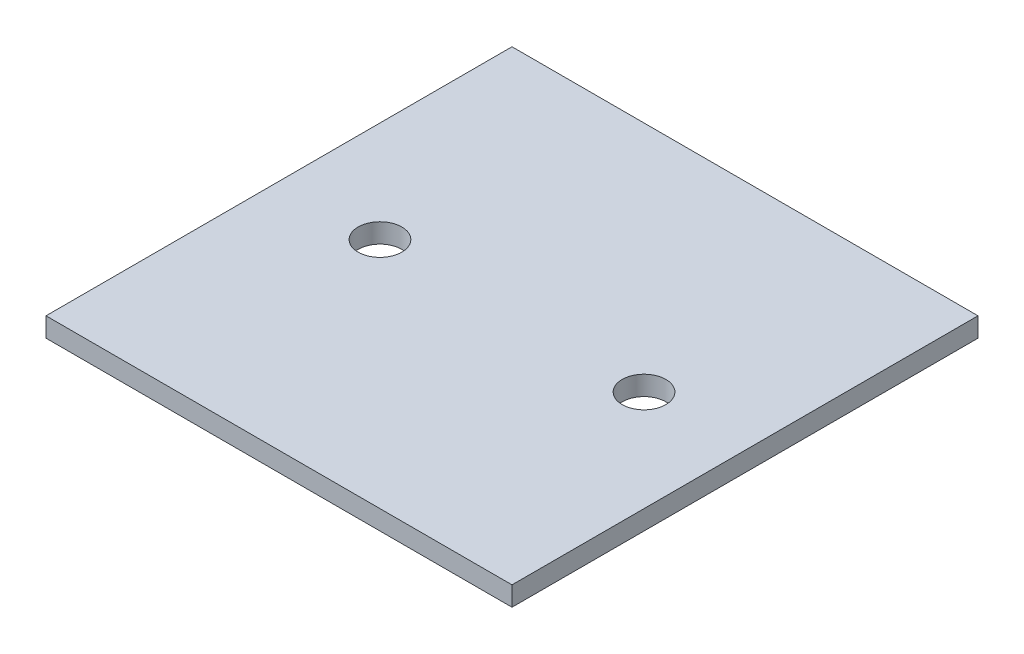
from build123d import *

# Parameters (mm, degrees)
SKETCH1_W           = 152.4
SKETCH1_H           = 152.4
BOSS_EXTRUDE1_DEPTH = 6.35
SKETCH2_R           = 7.14375
CUT_EXTRUDE1_DEPTH  = 25.4


with BuildPart() as part:
    # Sketch1 → Boss-Extrude1 (new body)
    with BuildSketch(Plane(origin=(0, 0, 0), x_dir=(1, 0, 0), z_dir=(0, 1, 0))):
        Rectangle(SKETCH1_W, SKETCH1_H)
    extrude(amount=BOSS_EXTRUDE1_DEPTH)

    # Sketch2 → Cut-Extrude1 (cut)
    with BuildSketch(Plane(origin=(0, 0, 0), x_dir=(1, 0, 0), z_dir=(0, 1, 0))):
        with Locations(Location((-43.18, 0, 0), (0, 0, 270))):
            Circle(SKETCH2_R)
        with Locations(Location((43.18, 0, 0), (0, 0, 270))):
            Circle(SKETCH2_R)
    extrude(amount=CUT_EXTRUDE1_DEPTH, mode=Mode.SUBTRACT)


solid = part.part
